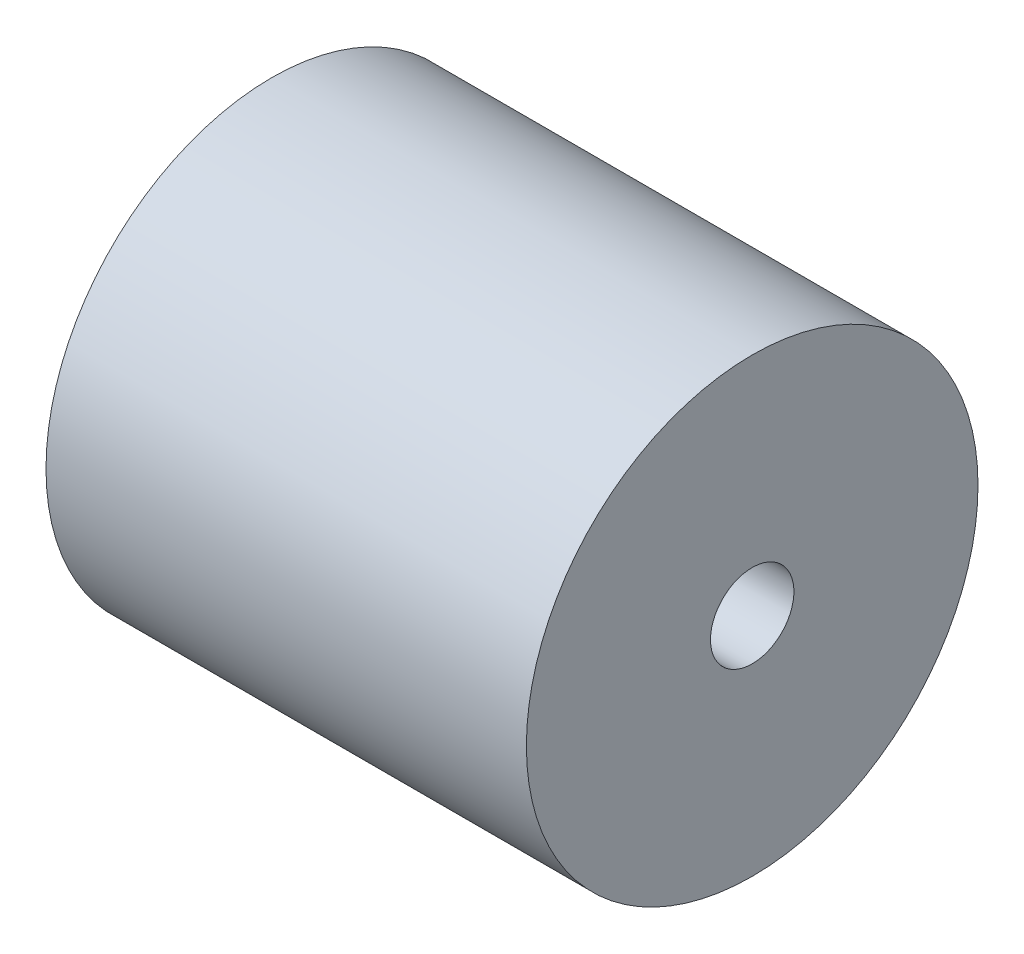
ISO-10303-21;
HEADER;
FILE_DESCRIPTION(('STEP AP214'),'2;1');
FILE_NAME('part.step','',(''),(''),'','','');
FILE_SCHEMA(('AUTOMOTIVE_DESIGN { 1 0 10303 214 1 1 1 1 }'));
ENDSEC;
DATA;
#1=APPLICATION_CONTEXT('core data for automotive mechanical design processes');
#2=APPLICATION_PROTOCOL_DEFINITION('international standard','automotive_design',2000,#1);
#3=PRODUCT_CONTEXT('',#1,'mechanical');
#4=PRODUCT('Part','Part','',(#3));
#5=PRODUCT_RELATED_PRODUCT_CATEGORY('part','',(#4));
#6=PRODUCT_DEFINITION_FORMATION('','',#4);
#7=PRODUCT_DEFINITION_CONTEXT('part definition',#1,'design');
#8=PRODUCT_DEFINITION('design','',#6,#7);
#9=PRODUCT_DEFINITION_SHAPE('','',#8);
#10=(LENGTH_UNIT() NAMED_UNIT(*) SI_UNIT(.MILLI.,.METRE.));
#11=(NAMED_UNIT(*) PLANE_ANGLE_UNIT() SI_UNIT($,.RADIAN.));
#12=(NAMED_UNIT(*) SI_UNIT($,.STERADIAN.) SOLID_ANGLE_UNIT());
#13=UNCERTAINTY_MEASURE_WITH_UNIT(LENGTH_MEASURE(1.E-05),#10,'distance_accuracy_value','');
#14=(GEOMETRIC_REPRESENTATION_CONTEXT(3) GLOBAL_UNCERTAINTY_ASSIGNED_CONTEXT((#13)) GLOBAL_UNIT_ASSIGNED_CONTEXT((#10,
#11,#12)) REPRESENTATION_CONTEXT('',''));
#15=CARTESIAN_POINT('',(0.,0.,0.));
#16=DIRECTION('',(0.,0.,1.));
#17=DIRECTION('',(1.,0.,0.));
#18=AXIS2_PLACEMENT_3D('',#15,#16,#17);
#19=CARTESIAN_POINT('',(-18.6018641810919,41.8109187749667,0.));
#20=DIRECTION('',(1.,0.,0.));
#21=DIRECTION('',(0.,0.,-1.));
#22=AXIS2_PLACEMENT_3D('',#19,#20,#21);
#23=PLANE('',#22);
#24=CARTESIAN_POINT('',(-18.6018641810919,0.,0.));
#25=DIRECTION('',(-1.,0.,0.));
#26=DIRECTION('',(0.,0.,1.));
#27=AXIS2_PLACEMENT_3D('',#24,#25,#26);
#28=CIRCLE('',#27,8.78828229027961);
#29=CARTESIAN_POINT('',(-18.6018641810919,0.,8.78828229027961));
#30=VERTEX_POINT('',#29);
#31=EDGE_CURVE('E10',#30,#30,#28,.T.);
#32=ORIENTED_EDGE('',*,*,#31,.F.);
#33=EDGE_LOOP('',(#32));
#34=FACE_BOUND('',#33,.T.);
#35=CARTESIAN_POINT('',(-18.6018641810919,0.,0.));
#36=DIRECTION('',(-1.,0.,0.));
#37=DIRECTION('',(0.,0.,1.));
#38=AXIS2_PLACEMENT_3D('',#35,#36,#37);
#39=CIRCLE('',#38,41.8109187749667);
#40=CARTESIAN_POINT('',(-18.6018641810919,0.,41.8109187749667));
#41=VERTEX_POINT('',#40);
#42=EDGE_CURVE('E57',#41,#41,#39,.T.);
#43=ORIENTED_EDGE('',*,*,#42,.T.);
#44=EDGE_LOOP('',(#43));
#45=FACE_BOUND('',#44,.T.);
#46=ADVANCED_FACE('F29',(#34,#45),#23,.F.);
#47=CARTESIAN_POINT('',(0.,0.,0.));
#48=DIRECTION('',(-1.,0.,0.));
#49=DIRECTION('',(0.,0.,1.));
#50=AXIS2_PLACEMENT_3D('',#47,#48,#49);
#51=CYLINDRICAL_SURFACE('',#50,8.78828229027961);
#52=CARTESIAN_POINT('',(30.6657789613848,0.,0.));
#53=DIRECTION('',(-1.,0.,0.));
#54=DIRECTION('',(0.,0.,1.));
#55=AXIS2_PLACEMENT_3D('',#52,#53,#54);
#56=CIRCLE('',#55,8.78828229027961);
#57=CARTESIAN_POINT('',(30.6657789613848,0.,8.78828229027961));
#58=VERTEX_POINT('',#57);
#59=EDGE_CURVE('E35',#58,#58,#56,.T.);
#60=ORIENTED_EDGE('',*,*,#59,.F.);
#61=EDGE_LOOP('',(#60));
#62=FACE_BOUND('',#61,.T.);
#63=ORIENTED_EDGE('',*,*,#31,.T.);
#64=EDGE_LOOP('',(#63));
#65=FACE_BOUND('',#64,.T.);
#66=ADVANCED_FACE('F94',(#62,#65),#51,.F.);
#67=CARTESIAN_POINT('',(30.6657789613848,0.,0.));
#68=DIRECTION('',(-1.,0.,0.));
#69=DIRECTION('',(0.,0.,1.));
#70=AXIS2_PLACEMENT_3D('',#67,#68,#69);
#71=CONICAL_SURFACE('',#70,8.78828229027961,0.942000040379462);
#72=CARTESIAN_POINT('',(32.7962716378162,0.,0.));
#73=DIRECTION('',(-1.,0.,0.));
#74=DIRECTION('',(0.,0.,1.));
#75=AXIS2_PLACEMENT_3D('',#72,#73,#74);
#76=CIRCLE('',#75,5.85885486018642);
#77=CARTESIAN_POINT('',(32.7962716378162,0.,5.85885486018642));
#78=VERTEX_POINT('',#77);
#79=EDGE_CURVE('E39',#78,#78,#76,.T.);
#80=ORIENTED_EDGE('',*,*,#79,.F.);
#81=EDGE_LOOP('',(#80));
#82=FACE_BOUND('',#81,.T.);
#83=ORIENTED_EDGE('',*,*,#59,.T.);
#84=EDGE_LOOP('',(#83));
#85=FACE_BOUND('',#84,.T.);
#86=ADVANCED_FACE('F89',(#82,#85),#71,.F.);
#87=CARTESIAN_POINT('',(0.,0.,0.));
#88=DIRECTION('',(-1.,0.,0.));
#89=DIRECTION('',(0.,0.,1.));
#90=AXIS2_PLACEMENT_3D('',#87,#88,#89);
#91=CYLINDRICAL_SURFACE('',#90,5.85885486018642);
#92=CARTESIAN_POINT('',(49.8402130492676,0.,0.));
#93=DIRECTION('',(-1.,0.,0.));
#94=DIRECTION('',(0.,0.,1.));
#95=AXIS2_PLACEMENT_3D('',#92,#93,#94);
#96=CIRCLE('',#95,5.85885486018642);
#97=CARTESIAN_POINT('',(49.8402130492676,0.,5.85885486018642));
#98=VERTEX_POINT('',#97);
#99=EDGE_CURVE('E43',#98,#98,#96,.T.);
#100=ORIENTED_EDGE('',*,*,#99,.F.);
#101=EDGE_LOOP('',(#100));
#102=FACE_BOUND('',#101,.T.);
#103=ORIENTED_EDGE('',*,*,#79,.T.);
#104=EDGE_LOOP('',(#103));
#105=FACE_BOUND('',#104,.T.);
#106=ADVANCED_FACE('F83',(#102,#105),#91,.F.);
#107=CARTESIAN_POINT('',(49.8402130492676,0.,0.));
#108=DIRECTION('',(1.,0.,0.));
#109=DIRECTION('',(0.,0.,-1.));
#110=AXIS2_PLACEMENT_3D('',#107,#108,#109);
#111=CONICAL_SURFACE('',#110,5.85885486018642,0.628796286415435);
#112=CARTESIAN_POINT('',(52.4034620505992,0.,0.));
#113=DIRECTION('',(-1.,0.,0.));
#114=DIRECTION('',(0.,0.,1.));
#115=AXIS2_PLACEMENT_3D('',#112,#113,#114);
#116=CIRCLE('',#115,7.72303595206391);
#117=CARTESIAN_POINT('',(52.4034620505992,0.,7.72303595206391));
#118=VERTEX_POINT('',#117);
#119=EDGE_CURVE('E48',#118,#118,#116,.T.);
#120=ORIENTED_EDGE('',*,*,#119,.F.);
#121=EDGE_LOOP('',(#120));
#122=FACE_BOUND('',#121,.T.);
#123=ORIENTED_EDGE('',*,*,#99,.T.);
#124=EDGE_LOOP('',(#123));
#125=FACE_BOUND('',#124,.T.);
#126=ADVANCED_FACE('F77',(#122,#125),#111,.F.);
#127=CARTESIAN_POINT('',(0.,0.,0.));
#128=DIRECTION('',(-1.,0.,0.));
#129=DIRECTION('',(0.,0.,1.));
#130=AXIS2_PLACEMENT_3D('',#127,#128,#129);
#131=CYLINDRICAL_SURFACE('',#130,7.7230359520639);
#132=CARTESIAN_POINT('',(70.3462050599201,0.,0.));
#133=DIRECTION('',(-1.,0.,0.));
#134=DIRECTION('',(0.,0.,1.));
#135=AXIS2_PLACEMENT_3D('',#132,#133,#134);
#136=CIRCLE('',#135,7.7230359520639);
#137=CARTESIAN_POINT('',(70.3462050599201,0.,7.7230359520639));
#138=VERTEX_POINT('',#137);
#139=EDGE_CURVE('E51',#138,#138,#136,.T.);
#140=ORIENTED_EDGE('',*,*,#139,.F.);
#141=EDGE_LOOP('',(#140));
#142=FACE_BOUND('',#141,.T.);
#143=ORIENTED_EDGE('',*,*,#119,.T.);
#144=EDGE_LOOP('',(#143));
#145=FACE_BOUND('',#144,.T.);
#146=ADVANCED_FACE('F71',(#142,#145),#131,.F.);
#147=CARTESIAN_POINT('',(70.3462050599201,7.7230359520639,0.));
#148=DIRECTION('',(-1.,0.,0.));
#149=DIRECTION('',(0.,0.,1.));
#150=AXIS2_PLACEMENT_3D('',#147,#148,#149);
#151=PLANE('',#150);
#152=CARTESIAN_POINT('',(70.3462050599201,0.,0.));
#153=DIRECTION('',(-1.,0.,0.));
#154=DIRECTION('',(0.,0.,1.));
#155=AXIS2_PLACEMENT_3D('',#152,#153,#154);
#156=CIRCLE('',#155,41.8109187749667);
#157=CARTESIAN_POINT('',(70.3462050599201,0.,41.8109187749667));
#158=VERTEX_POINT('',#157);
#159=EDGE_CURVE('E54',#158,#158,#156,.T.);
#160=ORIENTED_EDGE('',*,*,#159,.F.);
#161=EDGE_LOOP('',(#160));
#162=FACE_BOUND('',#161,.T.);
#163=ORIENTED_EDGE('',*,*,#139,.T.);
#164=EDGE_LOOP('',(#163));
#165=FACE_BOUND('',#164,.T.);
#166=ADVANCED_FACE('F65',(#162,#165),#151,.F.);
#167=CARTESIAN_POINT('',(0.,0.,0.));
#168=DIRECTION('',(-1.,0.,0.));
#169=DIRECTION('',(0.,0.,1.));
#170=AXIS2_PLACEMENT_3D('',#167,#168,#169);
#171=CYLINDRICAL_SURFACE('',#170,41.8109187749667);
#172=ORIENTED_EDGE('',*,*,#42,.F.);
#173=EDGE_LOOP('',(#172));
#174=FACE_BOUND('',#173,.T.);
#175=ORIENTED_EDGE('',*,*,#159,.T.);
#176=EDGE_LOOP('',(#175));
#177=FACE_BOUND('',#176,.T.);
#178=ADVANCED_FACE('F62',(#174,#177),#171,.T.);
#179=CLOSED_SHELL('',(#46,#66,#86,#106,#126,#146,#166,#178));
#180=MANIFOLD_SOLID_BREP('B2',#179);
#181=ADVANCED_BREP_SHAPE_REPRESENTATION('',(#18,#180),#14);
#182=SHAPE_DEFINITION_REPRESENTATION(#9,#181);
ENDSEC;
END-ISO-10303-21;
